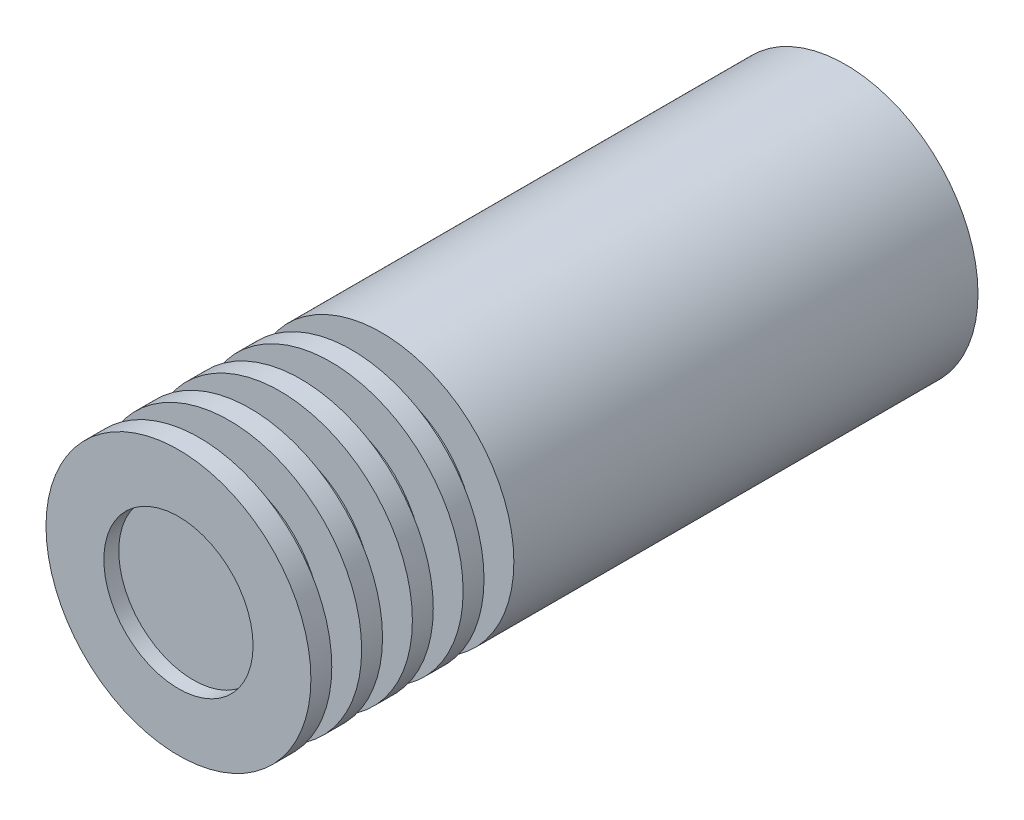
from build123d import *

# Parameters (mm, degrees)
SKETCH1_R           = 8.875
BOSS_EXTRUDE1_DEPTH = 44.7
SKETCH2_W           = 2
SKETCH2_H           = 2.7
SKETCH3_R           = 5
CUT_EXTRUDE1_DEPTH  = 1


with BuildPart() as part:
    # Sketch1 → Boss-Extrude1 (new body)
    with BuildSketch(Plane.XY):
        with Locations(Location((0, 0, 0), (0, 0, 180))):
            Circle(SKETCH1_R)
    extrude(amount=BOSS_EXTRUDE1_DEPTH)

    # Sketch2 → Cut-Revolve1 (revolve, cut)
    with BuildSketch(Plane(origin=(0, 0, 0), x_dir=(0, 0, -1), z_dir=(1, 0, 0)), mode=Mode.PRIVATE) as cut_revolve1_sk:
        with Locations((-42.3, 7.525)):
            Rectangle(SKETCH2_W, SKETCH2_H)
        with Locations((-38.9, 7.525)):
            Rectangle(SKETCH2_W, SKETCH2_H)
        with Locations((-35.5, 7.525)):
            Rectangle(SKETCH2_W, SKETCH2_H)
        with Locations((-32.1, 7.525)):
            Rectangle(SKETCH2_W, SKETCH2_H)
    revolve(cut_revolve1_sk.sketch.rotate(Axis((0, 0, 44.7), (0, 0, -1)), 270), axis=Axis((0, 0, 44.7), (0, 0, -1)), mode=Mode.SUBTRACT)

    # Sketch3 → Cut-Extrude1 (cut)
    with BuildSketch(Plane.XY.offset(44.7)):
        Circle(SKETCH3_R)
    extrude(amount=-CUT_EXTRUDE1_DEPTH, mode=Mode.SUBTRACT)


solid = part.part
